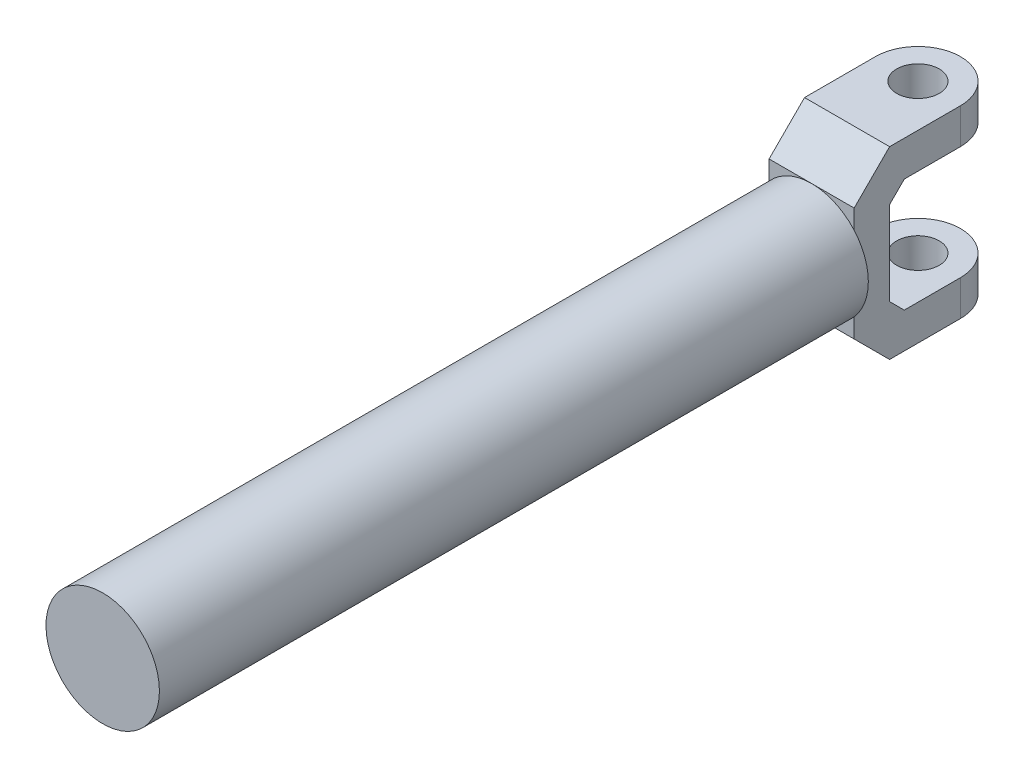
ISO-10303-21;
HEADER;
FILE_DESCRIPTION(('STEP AP214'),'2;1');
FILE_NAME('part.step','',(''),(''),'','','');
FILE_SCHEMA(('AUTOMOTIVE_DESIGN { 1 0 10303 214 1 1 1 1 }'));
ENDSEC;
DATA;
#1=APPLICATION_CONTEXT('core data for automotive mechanical design processes');
#2=APPLICATION_PROTOCOL_DEFINITION('international standard','automotive_design',2000,#1);
#3=PRODUCT_CONTEXT('',#1,'mechanical');
#4=PRODUCT('Part','Part','',(#3));
#5=PRODUCT_RELATED_PRODUCT_CATEGORY('part','',(#4));
#6=PRODUCT_DEFINITION_FORMATION('','',#4);
#7=PRODUCT_DEFINITION_CONTEXT('part definition',#1,'design');
#8=PRODUCT_DEFINITION('design','',#6,#7);
#9=PRODUCT_DEFINITION_SHAPE('','',#8);
#10=(LENGTH_UNIT() NAMED_UNIT(*) SI_UNIT(.MILLI.,.METRE.));
#11=(NAMED_UNIT(*) PLANE_ANGLE_UNIT() SI_UNIT($,.RADIAN.));
#12=(NAMED_UNIT(*) SI_UNIT($,.STERADIAN.) SOLID_ANGLE_UNIT());
#13=UNCERTAINTY_MEASURE_WITH_UNIT(LENGTH_MEASURE(1.E-05),#10,'distance_accuracy_value','');
#14=(GEOMETRIC_REPRESENTATION_CONTEXT(3) GLOBAL_UNCERTAINTY_ASSIGNED_CONTEXT((#13)) GLOBAL_UNIT_ASSIGNED_CONTEXT((#10,
#11,#12)) REPRESENTATION_CONTEXT('',''));
#15=CARTESIAN_POINT('',(0.,0.,0.));
#16=DIRECTION('',(0.,0.,1.));
#17=DIRECTION('',(1.,0.,0.));
#18=AXIS2_PLACEMENT_3D('',#15,#16,#17);
#19=CARTESIAN_POINT('',(0.,0.,0.));
#20=DIRECTION('',(0.,0.,1.));
#21=DIRECTION('',(1.,0.,0.));
#22=AXIS2_PLACEMENT_3D('',#19,#20,#21);
#23=PLANE('',#22);
#24=DIRECTION('',(0.,-1.,0.));
#25=VECTOR('',#24,1.);
#26=CARTESIAN_POINT('',(30.,-40.,0.));
#27=LINE('',#26,#25);
#28=CARTESIAN_POINT('',(30.,26.4575131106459,0.));
#29=VERTEX_POINT('',#28);
#30=CARTESIAN_POINT('',(30.,-26.4575131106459,0.));
#31=VERTEX_POINT('',#30);
#32=EDGE_CURVE('E173',#29,#31,#27,.T.);
#33=ORIENTED_EDGE('',*,*,#32,.F.);
#34=CARTESIAN_POINT('',(0.,0.,0.));
#35=DIRECTION('',(0.,0.,1.));
#36=DIRECTION('',(1.,0.,0.));
#37=AXIS2_PLACEMENT_3D('',#34,#35,#36);
#38=CIRCLE('',#37,40.);
#39=EDGE_CURVE('E188',#31,#29,#38,.T.);
#40=ORIENTED_EDGE('',*,*,#39,.F.);
#41=EDGE_LOOP('',(#33,#40));
#42=FACE_BOUND('',#41,.T.);
#43=ADVANCED_FACE('F41',(#42),#23,.F.);
#44=CARTESIAN_POINT('',(0.,0.,500.));
#45=DIRECTION('',(0.,0.,-1.));
#46=DIRECTION('',(-1.,0.,0.));
#47=AXIS2_PLACEMENT_3D('',#44,#45,#46);
#48=CYLINDRICAL_SURFACE('',#47,40.);
#49=CARTESIAN_POINT('',(0.,0.,500.));
#50=DIRECTION('',(0.,0.,1.));
#51=DIRECTION('',(1.,0.,0.));
#52=AXIS2_PLACEMENT_3D('',#49,#50,#51);
#53=CIRCLE('',#52,40.);
#54=CARTESIAN_POINT('',(40.,0.,500.));
#55=VERTEX_POINT('',#54);
#56=EDGE_CURVE('E197',#55,#55,#53,.T.);
#57=ORIENTED_EDGE('',*,*,#56,.F.);
#58=EDGE_LOOP('',(#57));
#59=FACE_BOUND('',#58,.T.);
#60=CARTESIAN_POINT('',(0.,40.,0.));
#61=VERTEX_POINT('',#60);
#62=EDGE_CURVE('E167',#29,#61,#38,.T.);
#63=ORIENTED_EDGE('',*,*,#62,.T.);
#64=CARTESIAN_POINT('',(-30.,26.4575131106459,0.));
#65=VERTEX_POINT('',#64);
#66=EDGE_CURVE('E200',#61,#65,#38,.T.);
#67=ORIENTED_EDGE('',*,*,#66,.T.);
#68=CARTESIAN_POINT('',(-30.,-26.4575131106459,0.));
#69=VERTEX_POINT('',#68);
#70=EDGE_CURVE('E377',#65,#69,#38,.T.);
#71=ORIENTED_EDGE('',*,*,#70,.T.);
#72=CARTESIAN_POINT('',(0.,-40.,0.));
#73=VERTEX_POINT('',#72);
#74=EDGE_CURVE('E308',#69,#73,#38,.T.);
#75=ORIENTED_EDGE('',*,*,#74,.T.);
#76=EDGE_CURVE('E191',#73,#31,#38,.T.);
#77=ORIENTED_EDGE('',*,*,#76,.T.);
#78=ORIENTED_EDGE('',*,*,#39,.T.);
#79=EDGE_LOOP('',(#63,#67,#71,#75,#77,#78));
#80=FACE_BOUND('',#79,.T.);
#81=ADVANCED_FACE('F356',(#59,#80),#48,.T.);
#82=CARTESIAN_POINT('',(0.,0.,500.));
#83=DIRECTION('',(0.,0.,1.));
#84=DIRECTION('',(1.,0.,0.));
#85=AXIS2_PLACEMENT_3D('',#82,#83,#84);
#86=PLANE('',#85);
#87=ORIENTED_EDGE('',*,*,#56,.T.);
#88=EDGE_LOOP('',(#87));
#89=FACE_BOUND('',#88,.T.);
#90=ADVANCED_FACE('F363',(#89),#86,.T.);
#91=ORIENTED_EDGE('',*,*,#70,.F.);
#92=DIRECTION('',(0.,-1.,0.));
#93=VECTOR('',#92,1.);
#94=CARTESIAN_POINT('',(-30.,-40.,0.));
#95=LINE('',#94,#93);
#96=EDGE_CURVE('E204',#65,#69,#95,.T.);
#97=ORIENTED_EDGE('',*,*,#96,.T.);
#98=EDGE_LOOP('',(#91,#97));
#99=FACE_BOUND('',#98,.T.);
#100=ADVANCED_FACE('F359',(#99),#23,.F.);
#101=CARTESIAN_POINT('',(30.,-40.,0.));
#102=DIRECTION('',(0.,0.,-1.));
#103=DIRECTION('',(-1.,0.,0.));
#104=AXIS2_PLACEMENT_3D('',#101,#102,#103);
#105=PLANE('',#104);
#106=ORIENTED_EDGE('',*,*,#62,.F.);
#107=CARTESIAN_POINT('',(30.,40.,0.));
#108=VERTEX_POINT('',#107);
#109=EDGE_CURVE('E162',#108,#29,#27,.T.);
#110=ORIENTED_EDGE('',*,*,#109,.F.);
#111=DIRECTION('',(-1.,0.,0.));
#112=VECTOR('',#111,1.);
#113=CARTESIAN_POINT('',(30.,40.,0.));
#114=LINE('',#113,#112);
#115=EDGE_CURVE('E166',#108,#61,#114,.T.);
#116=ORIENTED_EDGE('',*,*,#115,.T.);
#117=EDGE_LOOP('',(#106,#110,#116));
#118=FACE_BOUND('',#117,.T.);
#119=ADVANCED_FACE('F164',(#118),#105,.F.);
#120=ORIENTED_EDGE('',*,*,#66,.F.);
#121=CARTESIAN_POINT('',(-30.,40.,0.));
#122=VERTEX_POINT('',#121);
#123=EDGE_CURVE('E187',#61,#122,#114,.T.);
#124=ORIENTED_EDGE('',*,*,#123,.T.);
#125=EDGE_CURVE('E258',#122,#65,#95,.T.);
#126=ORIENTED_EDGE('',*,*,#125,.T.);
#127=EDGE_LOOP('',(#120,#124,#126));
#128=FACE_BOUND('',#127,.T.);
#129=ADVANCED_FACE('F373',(#128),#105,.F.);
#130=ORIENTED_EDGE('',*,*,#74,.F.);
#131=CARTESIAN_POINT('',(-30.,-40.,0.));
#132=VERTEX_POINT('',#131);
#133=EDGE_CURVE('E256',#69,#132,#95,.T.);
#134=ORIENTED_EDGE('',*,*,#133,.T.);
#135=DIRECTION('',(-1.,0.,0.));
#136=VECTOR('',#135,1.);
#137=CARTESIAN_POINT('',(30.,-40.,0.));
#138=LINE('',#137,#136);
#139=EDGE_CURVE('E290',#73,#132,#138,.T.);
#140=ORIENTED_EDGE('',*,*,#139,.F.);
#141=EDGE_LOOP('',(#130,#134,#140));
#142=FACE_BOUND('',#141,.T.);
#143=ADVANCED_FACE('F311',(#142),#105,.F.);
#144=CARTESIAN_POINT('',(30.,40.,0.));
#145=DIRECTION('',(0.,-0.707106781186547,-0.707106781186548));
#146=DIRECTION('',(0.,0.707106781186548,-0.707106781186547));
#147=AXIS2_PLACEMENT_3D('',#144,#145,#146);
#148=PLANE('',#147);
#149=DIRECTION('',(0.,-0.707106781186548,0.707106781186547));
#150=VECTOR('',#149,1.);
#151=CARTESIAN_POINT('',(-30.,40.,0.));
#152=LINE('',#151,#150);
#153=CARTESIAN_POINT('',(-30.,65.,-25.));
#154=VERTEX_POINT('',#153);
#155=EDGE_CURVE('E254',#154,#122,#152,.T.);
#156=ORIENTED_EDGE('',*,*,#155,.T.);
#157=ORIENTED_EDGE('',*,*,#123,.F.);
#158=ORIENTED_EDGE('',*,*,#115,.F.);
#159=DIRECTION('',(0.,-0.707106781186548,0.707106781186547));
#160=VECTOR('',#159,1.);
#161=CARTESIAN_POINT('',(30.,40.,0.));
#162=LINE('',#161,#160);
#163=CARTESIAN_POINT('',(30.,65.,-25.));
#164=VERTEX_POINT('',#163);
#165=EDGE_CURVE('E175',#164,#108,#162,.T.);
#166=ORIENTED_EDGE('',*,*,#165,.F.);
#167=DIRECTION('',(-1.,0.,0.));
#168=VECTOR('',#167,1.);
#169=CARTESIAN_POINT('',(30.,65.,-25.));
#170=LINE('',#169,#168);
#171=EDGE_CURVE('E248',#164,#154,#170,.T.);
#172=ORIENTED_EDGE('',*,*,#171,.T.);
#173=EDGE_LOOP('',(#156,#157,#158,#166,#172));
#174=FACE_BOUND('',#173,.T.);
#175=ADVANCED_FACE('F186',(#174),#148,.F.);
#176=ORIENTED_EDGE('',*,*,#76,.F.);
#177=CARTESIAN_POINT('',(30.,-40.,0.));
#178=VERTEX_POINT('',#177);
#179=EDGE_CURVE('E193',#178,#73,#138,.T.);
#180=ORIENTED_EDGE('',*,*,#179,.F.);
#181=EDGE_CURVE('E171',#31,#178,#27,.T.);
#182=ORIENTED_EDGE('',*,*,#181,.F.);
#183=EDGE_LOOP('',(#176,#180,#182));
#184=FACE_BOUND('',#183,.T.);
#185=ADVANCED_FACE('F305',(#184),#105,.F.);
#186=CARTESIAN_POINT('',(30.,-40.,0.));
#187=DIRECTION('',(0.,0.707106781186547,-0.707106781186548));
#188=DIRECTION('',(0.,0.707106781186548,0.707106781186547));
#189=AXIS2_PLACEMENT_3D('',#186,#187,#188);
#190=PLANE('',#189);
#191=DIRECTION('',(0.,-0.707106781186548,-0.707106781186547));
#192=VECTOR('',#191,1.);
#193=CARTESIAN_POINT('',(-30.,-40.,0.));
#194=LINE('',#193,#192);
#195=CARTESIAN_POINT('',(-30.,-65.,-25.));
#196=VERTEX_POINT('',#195);
#197=EDGE_CURVE('E261',#132,#196,#194,.T.);
#198=ORIENTED_EDGE('',*,*,#197,.T.);
#199=DIRECTION('',(-1.,0.,0.));
#200=VECTOR('',#199,1.);
#201=CARTESIAN_POINT('',(30.,-65.,-25.));
#202=LINE('',#201,#200);
#203=CARTESIAN_POINT('',(30.,-65.,-25.));
#204=VERTEX_POINT('',#203);
#205=EDGE_CURVE('E288',#204,#196,#202,.T.);
#206=ORIENTED_EDGE('',*,*,#205,.F.);
#207=DIRECTION('',(0.,-0.707106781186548,-0.707106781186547));
#208=VECTOR('',#207,1.);
#209=CARTESIAN_POINT('',(30.,-40.,0.));
#210=LINE('',#209,#208);
#211=EDGE_CURVE('E170',#178,#204,#210,.T.);
#212=ORIENTED_EDGE('',*,*,#211,.F.);
#213=ORIENTED_EDGE('',*,*,#179,.T.);
#214=ORIENTED_EDGE('',*,*,#139,.T.);
#215=EDGE_LOOP('',(#198,#206,#212,#213,#214));
#216=FACE_BOUND('',#215,.T.);
#217=ADVANCED_FACE('F301',(#216),#190,.F.);
#218=CARTESIAN_POINT('',(30.,-65.,-25.));
#219=DIRECTION('',(0.,1.,0.));
#220=DIRECTION('',(0.,0.,1.));
#221=AXIS2_PLACEMENT_3D('',#218,#219,#220);
#222=PLANE('',#221);
#223=CARTESIAN_POINT('',(0.,-65.,-75.));
#224=DIRECTION('',(0.,1.,0.));
#225=DIRECTION('',(0.,0.,1.));
#226=AXIS2_PLACEMENT_3D('',#223,#224,#225);
#227=CIRCLE('',#226,15.);
#228=CARTESIAN_POINT('',(0.,-65.,-60.));
#229=VERTEX_POINT('',#228);
#230=EDGE_CURVE('E230',#229,#229,#227,.T.);
#231=ORIENTED_EDGE('',*,*,#230,.T.);
#232=EDGE_LOOP('',(#231));
#233=FACE_BOUND('',#232,.T.);
#234=DIRECTION('',(0.,0.,-1.));
#235=VECTOR('',#234,1.);
#236=CARTESIAN_POINT('',(-30.,-65.,-25.));
#237=LINE('',#236,#235);
#238=CARTESIAN_POINT('',(-30.,-65.,-75.));
#239=VERTEX_POINT('',#238);
#240=EDGE_CURVE('E263',#196,#239,#237,.T.);
#241=ORIENTED_EDGE('',*,*,#240,.T.);
#242=CARTESIAN_POINT('',(0.,-65.,-75.));
#243=DIRECTION('',(0.,1.,0.));
#244=DIRECTION('',(0.,0.,1.));
#245=AXIS2_PLACEMENT_3D('',#242,#243,#244);
#246=CIRCLE('',#245,30.);
#247=CARTESIAN_POINT('',(0.,-65.,-105.));
#248=VERTEX_POINT('',#247);
#249=EDGE_CURVE('E214',#239,#248,#246,.F.);
#250=ORIENTED_EDGE('',*,*,#249,.T.);
#251=CARTESIAN_POINT('',(0.,-65.,-75.));
#252=DIRECTION('',(0.,1.,0.));
#253=DIRECTION('',(0.,0.,1.));
#254=AXIS2_PLACEMENT_3D('',#251,#252,#253);
#255=CIRCLE('',#254,30.);
#256=CARTESIAN_POINT('',(30.,-65.,-75.));
#257=VERTEX_POINT('',#256);
#258=EDGE_CURVE('E212',#248,#257,#255,.F.);
#259=ORIENTED_EDGE('',*,*,#258,.T.);
#260=DIRECTION('',(0.,0.,-1.));
#261=VECTOR('',#260,1.);
#262=CARTESIAN_POINT('',(30.,-65.,-25.));
#263=LINE('',#262,#261);
#264=EDGE_CURVE('E318',#204,#257,#263,.T.);
#265=ORIENTED_EDGE('',*,*,#264,.F.);
#266=ORIENTED_EDGE('',*,*,#205,.T.);
#267=EDGE_LOOP('',(#241,#250,#259,#265,#266));
#268=FACE_BOUND('',#267,.T.);
#269=ADVANCED_FACE('F319',(#233,#268),#222,.F.);
#270=CARTESIAN_POINT('',(30.,-40.,-105.));
#271=DIRECTION('',(0.,-1.,0.));
#272=DIRECTION('',(0.,0.,-1.));
#273=AXIS2_PLACEMENT_3D('',#270,#271,#272);
#274=PLANE('',#273);
#275=CARTESIAN_POINT('',(0.,-40.,-75.));
#276=DIRECTION('',(0.,-1.,0.));
#277=DIRECTION('',(0.,0.,-1.));
#278=AXIS2_PLACEMENT_3D('',#275,#276,#277);
#279=CIRCLE('',#278,15.);
#280=CARTESIAN_POINT('',(0.,-40.,-90.));
#281=VERTEX_POINT('',#280);
#282=EDGE_CURVE('E257',#281,#281,#279,.T.);
#283=ORIENTED_EDGE('',*,*,#282,.T.);
#284=EDGE_LOOP('',(#283));
#285=FACE_BOUND('',#284,.T.);
#286=CARTESIAN_POINT('',(0.,-40.,-75.));
#287=DIRECTION('',(0.,-1.,0.));
#288=DIRECTION('',(0.,0.,-1.));
#289=AXIS2_PLACEMENT_3D('',#286,#287,#288);
#290=CIRCLE('',#289,30.);
#291=CARTESIAN_POINT('',(30.,-40.,-75.));
#292=VERTEX_POINT('',#291);
#293=CARTESIAN_POINT('',(0.,-40.,-105.));
#294=VERTEX_POINT('',#293);
#295=EDGE_CURVE('E201',#292,#294,#290,.F.);
#296=ORIENTED_EDGE('',*,*,#295,.T.);
#297=CARTESIAN_POINT('',(0.,-40.,-75.));
#298=DIRECTION('',(0.,-1.,0.));
#299=DIRECTION('',(0.,0.,-1.));
#300=AXIS2_PLACEMENT_3D('',#297,#298,#299);
#301=CIRCLE('',#300,30.);
#302=CARTESIAN_POINT('',(-30.,-40.,-75.));
#303=VERTEX_POINT('',#302);
#304=EDGE_CURVE('E203',#294,#303,#301,.F.);
#305=ORIENTED_EDGE('',*,*,#304,.T.);
#306=DIRECTION('',(0.,0.,1.));
#307=VECTOR('',#306,1.);
#308=CARTESIAN_POINT('',(-30.,-40.,-105.));
#309=LINE('',#308,#307);
#310=CARTESIAN_POINT('',(-30.,-40.,-35.3553390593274));
#311=VERTEX_POINT('',#310);
#312=EDGE_CURVE('E266',#303,#311,#309,.T.);
#313=ORIENTED_EDGE('',*,*,#312,.T.);
#314=DIRECTION('',(-1.,0.,0.));
#315=VECTOR('',#314,1.);
#316=CARTESIAN_POINT('',(30.,-40.,-35.3553390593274));
#317=LINE('',#316,#315);
#318=CARTESIAN_POINT('',(30.,-40.,-35.3553390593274));
#319=VERTEX_POINT('',#318);
#320=EDGE_CURVE('E286',#319,#311,#317,.T.);
#321=ORIENTED_EDGE('',*,*,#320,.F.);
#322=DIRECTION('',(0.,0.,1.));
#323=VECTOR('',#322,1.);
#324=CARTESIAN_POINT('',(30.,-40.,-105.));
#325=LINE('',#324,#323);
#326=EDGE_CURVE('E322',#292,#319,#325,.T.);
#327=ORIENTED_EDGE('',*,*,#326,.F.);
#328=EDGE_LOOP('',(#296,#305,#313,#321,#327));
#329=FACE_BOUND('',#328,.T.);
#330=ADVANCED_FACE('F410',(#285,#329),#274,.F.);
#331=CARTESIAN_POINT('',(30.,-40.,-35.3553390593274));
#332=DIRECTION('',(0.,-0.707106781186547,0.707106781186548));
#333=DIRECTION('',(0.,-0.707106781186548,-0.707106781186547));
#334=AXIS2_PLACEMENT_3D('',#331,#332,#333);
#335=PLANE('',#334);
#336=DIRECTION('',(0.,0.707106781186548,0.707106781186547));
#337=VECTOR('',#336,1.);
#338=CARTESIAN_POINT('',(-30.,-40.,-35.3553390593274));
#339=LINE('',#338,#337);
#340=CARTESIAN_POINT('',(-30.,-29.6446609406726,-25.));
#341=VERTEX_POINT('',#340);
#342=EDGE_CURVE('E268',#311,#341,#339,.T.);
#343=ORIENTED_EDGE('',*,*,#342,.T.);
#344=DIRECTION('',(-1.,0.,0.));
#345=VECTOR('',#344,1.);
#346=CARTESIAN_POINT('',(30.,-29.6446609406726,-25.));
#347=LINE('',#346,#345);
#348=CARTESIAN_POINT('',(30.,-29.6446609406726,-25.));
#349=VERTEX_POINT('',#348);
#350=EDGE_CURVE('E283',#349,#341,#347,.T.);
#351=ORIENTED_EDGE('',*,*,#350,.F.);
#352=DIRECTION('',(0.,0.707106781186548,0.707106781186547));
#353=VECTOR('',#352,1.);
#354=CARTESIAN_POINT('',(30.,-40.,-35.3553390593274));
#355=LINE('',#354,#353);
#356=EDGE_CURVE('E324',#319,#349,#355,.T.);
#357=ORIENTED_EDGE('',*,*,#356,.F.);
#358=ORIENTED_EDGE('',*,*,#320,.T.);
#359=EDGE_LOOP('',(#343,#351,#357,#358));
#360=FACE_BOUND('',#359,.T.);
#361=ADVANCED_FACE('F418',(#360),#335,.F.);
#362=CARTESIAN_POINT('',(30.,29.6446609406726,-25.));
#363=DIRECTION('',(0.,0.,1.));
#364=DIRECTION('',(1.,0.,0.));
#365=AXIS2_PLACEMENT_3D('',#362,#363,#364);
#366=PLANE('',#365);
#367=DIRECTION('',(0.,1.,0.));
#368=VECTOR('',#367,1.);
#369=CARTESIAN_POINT('',(-30.,29.6446609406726,-25.));
#370=LINE('',#369,#368);
#371=CARTESIAN_POINT('',(-30.,29.6446609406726,-25.));
#372=VERTEX_POINT('',#371);
#373=EDGE_CURVE('E270',#341,#372,#370,.T.);
#374=ORIENTED_EDGE('',*,*,#373,.T.);
#375=DIRECTION('',(-1.,0.,0.));
#376=VECTOR('',#375,1.);
#377=CARTESIAN_POINT('',(30.,29.6446609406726,-25.));
#378=LINE('',#377,#376);
#379=CARTESIAN_POINT('',(30.,29.6446609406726,-25.));
#380=VERTEX_POINT('',#379);
#381=EDGE_CURVE('E280',#380,#372,#378,.T.);
#382=ORIENTED_EDGE('',*,*,#381,.F.);
#383=DIRECTION('',(0.,1.,0.));
#384=VECTOR('',#383,1.);
#385=CARTESIAN_POINT('',(30.,29.6446609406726,-25.));
#386=LINE('',#385,#384);
#387=EDGE_CURVE('E250',#349,#380,#386,.T.);
#388=ORIENTED_EDGE('',*,*,#387,.F.);
#389=ORIENTED_EDGE('',*,*,#350,.T.);
#390=EDGE_LOOP('',(#374,#382,#388,#389));
#391=FACE_BOUND('',#390,.T.);
#392=ADVANCED_FACE('F333',(#391),#366,.F.);
#393=CARTESIAN_POINT('',(30.,40.,-35.3553390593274));
#394=DIRECTION('',(0.,0.707106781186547,0.707106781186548));
#395=DIRECTION('',(0.,-0.707106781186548,0.707106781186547));
#396=AXIS2_PLACEMENT_3D('',#393,#394,#395);
#397=PLANE('',#396);
#398=DIRECTION('',(0.,0.707106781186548,-0.707106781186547));
#399=VECTOR('',#398,1.);
#400=CARTESIAN_POINT('',(-30.,40.,-35.3553390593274));
#401=LINE('',#400,#399);
#402=CARTESIAN_POINT('',(-30.,40.,-35.3553390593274));
#403=VERTEX_POINT('',#402);
#404=EDGE_CURVE('E272',#372,#403,#401,.T.);
#405=ORIENTED_EDGE('',*,*,#404,.T.);
#406=DIRECTION('',(-1.,0.,0.));
#407=VECTOR('',#406,1.);
#408=CARTESIAN_POINT('',(30.,40.,-35.3553390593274));
#409=LINE('',#408,#407);
#410=CARTESIAN_POINT('',(30.,40.,-35.3553390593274));
#411=VERTEX_POINT('',#410);
#412=EDGE_CURVE('E278',#411,#403,#409,.T.);
#413=ORIENTED_EDGE('',*,*,#412,.F.);
#414=DIRECTION('',(0.,0.707106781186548,-0.707106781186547));
#415=VECTOR('',#414,1.);
#416=CARTESIAN_POINT('',(30.,40.,-35.3553390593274));
#417=LINE('',#416,#415);
#418=EDGE_CURVE('E245',#380,#411,#417,.T.);
#419=ORIENTED_EDGE('',*,*,#418,.F.);
#420=ORIENTED_EDGE('',*,*,#381,.T.);
#421=EDGE_LOOP('',(#405,#413,#419,#420));
#422=FACE_BOUND('',#421,.T.);
#423=ADVANCED_FACE('F337',(#422),#397,.F.);
#424=CARTESIAN_POINT('',(30.,40.,-105.));
#425=DIRECTION('',(0.,1.,0.));
#426=DIRECTION('',(0.,0.,1.));
#427=AXIS2_PLACEMENT_3D('',#424,#425,#426);
#428=PLANE('',#427);
#429=CARTESIAN_POINT('',(0.,40.,-75.));
#430=DIRECTION('',(0.,1.,0.));
#431=DIRECTION('',(0.,0.,1.));
#432=AXIS2_PLACEMENT_3D('',#429,#430,#431);
#433=CIRCLE('',#432,15.);
#434=CARTESIAN_POINT('',(0.,40.,-60.));
#435=VERTEX_POINT('',#434);
#436=EDGE_CURVE('E617',#435,#435,#433,.T.);
#437=ORIENTED_EDGE('',*,*,#436,.T.);
#438=EDGE_LOOP('',(#437));
#439=FACE_BOUND('',#438,.T.);
#440=DIRECTION('',(0.,0.,-1.));
#441=VECTOR('',#440,1.);
#442=CARTESIAN_POINT('',(-30.,40.,-105.));
#443=LINE('',#442,#441);
#444=CARTESIAN_POINT('',(-30.,40.,-75.));
#445=VERTEX_POINT('',#444);
#446=EDGE_CURVE('E274',#403,#445,#443,.T.);
#447=ORIENTED_EDGE('',*,*,#446,.T.);
#448=CARTESIAN_POINT('',(0.,40.,-75.));
#449=DIRECTION('',(0.,1.,0.));
#450=DIRECTION('',(0.,0.,1.));
#451=AXIS2_PLACEMENT_3D('',#448,#449,#450);
#452=CIRCLE('',#451,30.);
#453=CARTESIAN_POINT('',(0.,40.,-105.));
#454=VERTEX_POINT('',#453);
#455=EDGE_CURVE('E11',#445,#454,#452,.F.);
#456=ORIENTED_EDGE('',*,*,#455,.T.);
#457=CARTESIAN_POINT('',(0.,40.,-75.));
#458=DIRECTION('',(0.,1.,0.));
#459=DIRECTION('',(0.,0.,1.));
#460=AXIS2_PLACEMENT_3D('',#457,#458,#459);
#461=CIRCLE('',#460,30.);
#462=CARTESIAN_POINT('',(30.,40.,-75.));
#463=VERTEX_POINT('',#462);
#464=EDGE_CURVE('E50',#454,#463,#461,.F.);
#465=ORIENTED_EDGE('',*,*,#464,.T.);
#466=DIRECTION('',(0.,0.,-1.));
#467=VECTOR('',#466,1.);
#468=CARTESIAN_POINT('',(30.,40.,-105.));
#469=LINE('',#468,#467);
#470=EDGE_CURVE('E243',#411,#463,#469,.T.);
#471=ORIENTED_EDGE('',*,*,#470,.F.);
#472=ORIENTED_EDGE('',*,*,#412,.T.);
#473=EDGE_LOOP('',(#447,#456,#465,#471,#472));
#474=FACE_BOUND('',#473,.T.);
#475=ADVANCED_FACE('F241',(#439,#474),#428,.F.);
#476=CARTESIAN_POINT('',(30.,65.,-25.));
#477=DIRECTION('',(0.,-1.,0.));
#478=DIRECTION('',(0.,0.,-1.));
#479=AXIS2_PLACEMENT_3D('',#476,#477,#478);
#480=PLANE('',#479);
#481=CARTESIAN_POINT('',(0.,65.,-75.));
#482=DIRECTION('',(0.,1.,0.));
#483=DIRECTION('',(0.,0.,1.));
#484=AXIS2_PLACEMENT_3D('',#481,#482,#483);
#485=CIRCLE('',#484,15.);
#486=CARTESIAN_POINT('',(0.,65.,-60.));
#487=VERTEX_POINT('',#486);
#488=EDGE_CURVE('E225',#487,#487,#485,.T.);
#489=ORIENTED_EDGE('',*,*,#488,.F.);
#490=EDGE_LOOP('',(#489));
#491=FACE_BOUND('',#490,.T.);
#492=CARTESIAN_POINT('',(0.,65.,-75.));
#493=DIRECTION('',(0.,-1.,0.));
#494=DIRECTION('',(0.,0.,-1.));
#495=AXIS2_PLACEMENT_3D('',#492,#493,#494);
#496=CIRCLE('',#495,30.);
#497=CARTESIAN_POINT('',(30.,65.,-75.));
#498=VERTEX_POINT('',#497);
#499=CARTESIAN_POINT('',(0.,65.,-105.));
#500=VERTEX_POINT('',#499);
#501=EDGE_CURVE('E64',#498,#500,#496,.F.);
#502=ORIENTED_EDGE('',*,*,#501,.T.);
#503=CARTESIAN_POINT('',(0.,65.,-75.));
#504=DIRECTION('',(0.,-1.,0.));
#505=DIRECTION('',(0.,0.,-1.));
#506=AXIS2_PLACEMENT_3D('',#503,#504,#505);
#507=CIRCLE('',#506,30.);
#508=CARTESIAN_POINT('',(-30.,65.,-75.));
#509=VERTEX_POINT('',#508);
#510=EDGE_CURVE('E221',#500,#509,#507,.F.);
#511=ORIENTED_EDGE('',*,*,#510,.T.);
#512=DIRECTION('',(0.,0.,1.));
#513=VECTOR('',#512,1.);
#514=CARTESIAN_POINT('',(-30.,65.,-25.));
#515=LINE('',#514,#513);
#516=EDGE_CURVE('E182',#509,#154,#515,.T.);
#517=ORIENTED_EDGE('',*,*,#516,.T.);
#518=ORIENTED_EDGE('',*,*,#171,.F.);
#519=DIRECTION('',(0.,0.,1.));
#520=VECTOR('',#519,1.);
#521=CARTESIAN_POINT('',(30.,65.,-25.));
#522=LINE('',#521,#520);
#523=EDGE_CURVE('E178',#498,#164,#522,.T.);
#524=ORIENTED_EDGE('',*,*,#523,.F.);
#525=EDGE_LOOP('',(#502,#511,#517,#518,#524));
#526=FACE_BOUND('',#525,.T.);
#527=ADVANCED_FACE('F342',(#491,#526),#480,.F.);
#528=CARTESIAN_POINT('',(30.,0.,0.));
#529=DIRECTION('',(1.,0.,0.));
#530=DIRECTION('',(0.,0.,-1.));
#531=AXIS2_PLACEMENT_3D('',#528,#529,#530);
#532=PLANE('',#531);
#533=ORIENTED_EDGE('',*,*,#264,.T.);
#534=DIRECTION('',(0.,1.,0.));
#535=VECTOR('',#534,1.);
#536=CARTESIAN_POINT('',(30.,-40.,-75.));
#537=LINE('',#536,#535);
#538=EDGE_CURVE('E218',#257,#292,#537,.T.);
#539=ORIENTED_EDGE('',*,*,#538,.T.);
#540=ORIENTED_EDGE('',*,*,#326,.T.);
#541=ORIENTED_EDGE('',*,*,#356,.T.);
#542=ORIENTED_EDGE('',*,*,#387,.T.);
#543=ORIENTED_EDGE('',*,*,#418,.T.);
#544=ORIENTED_EDGE('',*,*,#470,.T.);
#545=DIRECTION('',(0.,1.,0.));
#546=VECTOR('',#545,1.);
#547=CARTESIAN_POINT('',(30.,65.,-75.));
#548=LINE('',#547,#546);
#549=EDGE_CURVE('E216',#463,#498,#548,.T.);
#550=ORIENTED_EDGE('',*,*,#549,.T.);
#551=ORIENTED_EDGE('',*,*,#523,.T.);
#552=ORIENTED_EDGE('',*,*,#165,.T.);
#553=ORIENTED_EDGE('',*,*,#109,.T.);
#554=ORIENTED_EDGE('',*,*,#32,.T.);
#555=ORIENTED_EDGE('',*,*,#181,.T.);
#556=ORIENTED_EDGE('',*,*,#211,.T.);
#557=EDGE_LOOP('',(#533,#539,#540,#541,#542,#543,#544,#550,#551,#552,#553,#554,#555,#556));
#558=FACE_BOUND('',#557,.T.);
#559=ADVANCED_FACE('F177',(#558),#532,.T.);
#560=CARTESIAN_POINT('',(-30.,0.,0.));
#561=DIRECTION('',(1.,0.,0.));
#562=DIRECTION('',(0.,0.,-1.));
#563=AXIS2_PLACEMENT_3D('',#560,#561,#562);
#564=PLANE('',#563);
#565=ORIENTED_EDGE('',*,*,#312,.F.);
#566=DIRECTION('',(0.,1.,0.));
#567=VECTOR('',#566,1.);
#568=CARTESIAN_POINT('',(-30.,0.,-75.));
#569=LINE('',#568,#567);
#570=EDGE_CURVE('E209',#303,#239,#569,.F.);
#571=ORIENTED_EDGE('',*,*,#570,.T.);
#572=ORIENTED_EDGE('',*,*,#240,.F.);
#573=ORIENTED_EDGE('',*,*,#197,.F.);
#574=ORIENTED_EDGE('',*,*,#133,.F.);
#575=ORIENTED_EDGE('',*,*,#96,.F.);
#576=ORIENTED_EDGE('',*,*,#125,.F.);
#577=ORIENTED_EDGE('',*,*,#155,.F.);
#578=ORIENTED_EDGE('',*,*,#516,.F.);
#579=DIRECTION('',(0.,1.,0.));
#580=VECTOR('',#579,1.);
#581=CARTESIAN_POINT('',(-30.,0.,-75.));
#582=LINE('',#581,#580);
#583=EDGE_CURVE('E206',#509,#445,#582,.F.);
#584=ORIENTED_EDGE('',*,*,#583,.T.);
#585=ORIENTED_EDGE('',*,*,#446,.F.);
#586=ORIENTED_EDGE('',*,*,#404,.F.);
#587=ORIENTED_EDGE('',*,*,#373,.F.);
#588=ORIENTED_EDGE('',*,*,#342,.F.);
#589=EDGE_LOOP('',(#565,#571,#572,#573,#574,#575,#576,#577,#578,#584,#585,#586,#587,#588));
#590=FACE_BOUND('',#589,.T.);
#591=ADVANCED_FACE('F317',(#590),#564,.F.);
#592=CARTESIAN_POINT('',(0.,-65.,-75.));
#593=DIRECTION('',(0.,1.,0.));
#594=DIRECTION('',(0.,0.,1.));
#595=AXIS2_PLACEMENT_3D('',#592,#593,#594);
#596=CYLINDRICAL_SURFACE('',#595,15.);
#597=ORIENTED_EDGE('',*,*,#488,.T.);
#598=EDGE_LOOP('',(#597));
#599=FACE_BOUND('',#598,.T.);
#600=ORIENTED_EDGE('',*,*,#436,.F.);
#601=EDGE_LOOP('',(#600));
#602=FACE_BOUND('',#601,.T.);
#603=ADVANCED_FACE('F465',(#599,#602),#596,.F.);
#604=ORIENTED_EDGE('',*,*,#230,.F.);
#605=EDGE_LOOP('',(#604));
#606=FACE_BOUND('',#605,.T.);
#607=ORIENTED_EDGE('',*,*,#282,.F.);
#608=EDGE_LOOP('',(#607));
#609=FACE_BOUND('',#608,.T.);
#610=ADVANCED_FACE('F478',(#606,#609),#596,.F.);
#611=CARTESIAN_POINT('',(0.,0.,-75.));
#612=DIRECTION('',(0.,-1.,0.));
#613=DIRECTION('',(0.,0.,-1.));
#614=AXIS2_PLACEMENT_3D('',#611,#612,#613);
#615=CYLINDRICAL_SURFACE('',#614,30.);
#616=ORIENTED_EDGE('',*,*,#538,.F.);
#617=ORIENTED_EDGE('',*,*,#258,.F.);
#618=DIRECTION('',(0.,1.,0.));
#619=VECTOR('',#618,1.);
#620=CARTESIAN_POINT('',(0.,-65.,-105.));
#621=LINE('',#620,#619);
#622=EDGE_CURVE('E223',#294,#248,#621,.F.);
#623=ORIENTED_EDGE('',*,*,#622,.F.);
#624=ORIENTED_EDGE('',*,*,#295,.F.);
#625=EDGE_LOOP('',(#616,#617,#623,#624));
#626=FACE_BOUND('',#625,.T.);
#627=ADVANCED_FACE('F472',(#626),#615,.T.);
#628=CARTESIAN_POINT('',(0.,-65.,-75.));
#629=DIRECTION('',(0.,1.,0.));
#630=DIRECTION('',(0.,0.,1.));
#631=AXIS2_PLACEMENT_3D('',#628,#629,#630);
#632=CYLINDRICAL_SURFACE('',#631,30.);
#633=ORIENTED_EDGE('',*,*,#249,.F.);
#634=ORIENTED_EDGE('',*,*,#570,.F.);
#635=ORIENTED_EDGE('',*,*,#304,.F.);
#636=ORIENTED_EDGE('',*,*,#622,.T.);
#637=EDGE_LOOP('',(#633,#634,#635,#636));
#638=FACE_BOUND('',#637,.T.);
#639=ADVANCED_FACE('F477',(#638),#632,.T.);
#640=CARTESIAN_POINT('',(0.,0.,-75.));
#641=DIRECTION('',(0.,-1.,0.));
#642=DIRECTION('',(0.,0.,-1.));
#643=AXIS2_PLACEMENT_3D('',#640,#641,#642);
#644=CYLINDRICAL_SURFACE('',#643,30.);
#645=ORIENTED_EDGE('',*,*,#549,.F.);
#646=ORIENTED_EDGE('',*,*,#464,.F.);
#647=DIRECTION('',(0.,1.,0.));
#648=VECTOR('',#647,1.);
#649=CARTESIAN_POINT('',(0.,40.,-105.));
#650=LINE('',#649,#648);
#651=EDGE_CURVE('E45',#500,#454,#650,.F.);
#652=ORIENTED_EDGE('',*,*,#651,.F.);
#653=ORIENTED_EDGE('',*,*,#501,.F.);
#654=EDGE_LOOP('',(#645,#646,#652,#653));
#655=FACE_BOUND('',#654,.T.);
#656=ADVANCED_FACE('F43',(#655),#644,.T.);
#657=CARTESIAN_POINT('',(0.,65.,-75.));
#658=DIRECTION('',(0.,1.,0.));
#659=DIRECTION('',(0.,0.,1.));
#660=AXIS2_PLACEMENT_3D('',#657,#658,#659);
#661=CYLINDRICAL_SURFACE('',#660,30.);
#662=ORIENTED_EDGE('',*,*,#455,.F.);
#663=ORIENTED_EDGE('',*,*,#583,.F.);
#664=ORIENTED_EDGE('',*,*,#510,.F.);
#665=ORIENTED_EDGE('',*,*,#651,.T.);
#666=EDGE_LOOP('',(#662,#663,#664,#665));
#667=FACE_BOUND('',#666,.T.);
#668=ADVANCED_FACE('F235',(#667),#661,.T.);
#669=CLOSED_SHELL('',(#43,#81,#90,#100,#119,#129,#143,#175,#185,#217,#269,#330,#361,#392,#423,
#475,#527,#559,#591,#603,#610,#627,#639,#656,#668));
#670=MANIFOLD_SOLID_BREP('B2',#669);
#671=ADVANCED_BREP_SHAPE_REPRESENTATION('',(#18,#670),#14);
#672=SHAPE_DEFINITION_REPRESENTATION(#9,#671);
ENDSEC;
END-ISO-10303-21;
